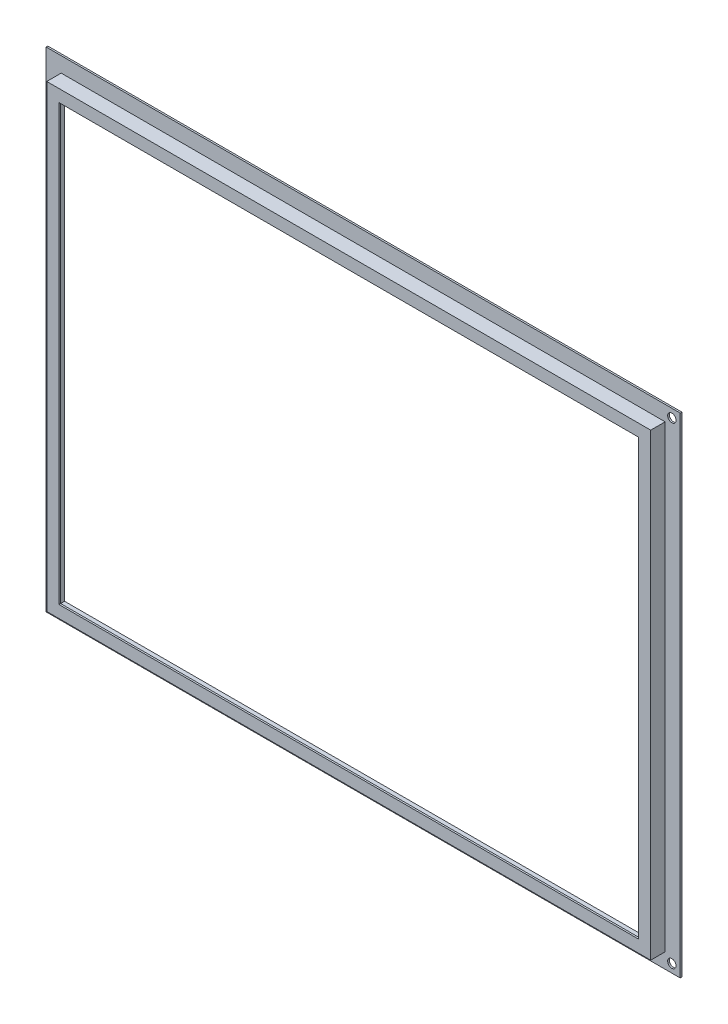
ISO-10303-21;
HEADER;
FILE_DESCRIPTION(('STEP AP214'),'2;1');
FILE_NAME('part.step','',(''),(''),'','','');
FILE_SCHEMA(('AUTOMOTIVE_DESIGN { 1 0 10303 214 1 1 1 1 }'));
ENDSEC;
DATA;
#1=APPLICATION_CONTEXT('core data for automotive mechanical design processes');
#2=APPLICATION_PROTOCOL_DEFINITION('international standard','automotive_design',2000,#1);
#3=PRODUCT_CONTEXT('',#1,'mechanical');
#4=PRODUCT('Part','Part','',(#3));
#5=PRODUCT_RELATED_PRODUCT_CATEGORY('part','',(#4));
#6=PRODUCT_DEFINITION_FORMATION('','',#4);
#7=PRODUCT_DEFINITION_CONTEXT('part definition',#1,'design');
#8=PRODUCT_DEFINITION('design','',#6,#7);
#9=PRODUCT_DEFINITION_SHAPE('','',#8);
#10=(LENGTH_UNIT() NAMED_UNIT(*) SI_UNIT(.MILLI.,.METRE.));
#11=(NAMED_UNIT(*) PLANE_ANGLE_UNIT() SI_UNIT($,.RADIAN.));
#12=(NAMED_UNIT(*) SI_UNIT($,.STERADIAN.) SOLID_ANGLE_UNIT());
#13=UNCERTAINTY_MEASURE_WITH_UNIT(LENGTH_MEASURE(1.E-05),#10,'distance_accuracy_value','');
#14=(GEOMETRIC_REPRESENTATION_CONTEXT(3) GLOBAL_UNCERTAINTY_ASSIGNED_CONTEXT((#13)) GLOBAL_UNIT_ASSIGNED_CONTEXT((#10,
#11,#12)) REPRESENTATION_CONTEXT('',''));
#15=CARTESIAN_POINT('',(0.,0.,0.));
#16=DIRECTION('',(0.,0.,1.));
#17=DIRECTION('',(1.,0.,0.));
#18=AXIS2_PLACEMENT_3D('',#15,#16,#17);
#19=CARTESIAN_POINT('',(178.969768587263,-136.790308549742,-459.709305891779));
#20=DIRECTION('',(0.,-1.,0.));
#21=DIRECTION('',(0.,0.,-1.));
#22=AXIS2_PLACEMENT_3D('',#19,#20,#21);
#23=PLANE('',#22);
#24=DIRECTION('',(0.,0.,1.));
#25=VECTOR('',#24,1.);
#26=CARTESIAN_POINT('',(-179.969768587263,-136.790308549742,-459.709305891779));
#27=LINE('',#26,#25);
#28=CARTESIAN_POINT('',(-179.969768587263,-136.790308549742,-7.6));
#29=VERTEX_POINT('',#28);
#30=CARTESIAN_POINT('',(-179.969768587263,-136.790308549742,1.));
#31=VERTEX_POINT('',#30);
#32=EDGE_CURVE('E281',#29,#31,#27,.T.);
#33=ORIENTED_EDGE('',*,*,#32,.F.);
#34=DIRECTION('',(1.,0.,0.));
#35=VECTOR('',#34,1.);
#36=CARTESIAN_POINT('',(178.969768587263,-136.790308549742,-7.6));
#37=LINE('',#36,#35);
#38=CARTESIAN_POINT('',(179.969768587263,-136.790308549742,-7.6));
#39=VERTEX_POINT('',#38);
#40=EDGE_CURVE('E291',#29,#39,#37,.T.);
#41=ORIENTED_EDGE('',*,*,#40,.T.);
#42=DIRECTION('',(0.,0.,1.));
#43=VECTOR('',#42,1.);
#44=CARTESIAN_POINT('',(179.969768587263,-136.790308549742,-459.709305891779));
#45=LINE('',#44,#43);
#46=CARTESIAN_POINT('',(179.969768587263,-136.790308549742,1.));
#47=VERTEX_POINT('',#46);
#48=EDGE_CURVE('E290',#39,#47,#45,.T.);
#49=ORIENTED_EDGE('',*,*,#48,.T.);
#50=DIRECTION('',(1.,0.,0.));
#51=VECTOR('',#50,1.);
#52=CARTESIAN_POINT('',(178.969768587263,-136.790308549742,1.));
#53=LINE('',#52,#51);
#54=EDGE_CURVE('E271',#31,#47,#53,.T.);
#55=ORIENTED_EDGE('',*,*,#54,.F.);
#56=EDGE_LOOP('',(#33,#41,#49,#55));
#57=FACE_BOUND('',#56,.T.);
#58=DIRECTION('',(-1.,0.,0.));
#59=VECTOR('',#58,1.);
#60=CARTESIAN_POINT('',(152.969768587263,-136.790308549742,-4.42500000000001));
#61=LINE('',#60,#59);
#62=CARTESIAN_POINT('',(152.969768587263,-136.790308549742,-4.42500000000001));
#63=VERTEX_POINT('',#62);
#64=CARTESIAN_POINT('',(102.469768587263,-136.790308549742,-4.42499999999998));
#65=VERTEX_POINT('',#64);
#66=EDGE_CURVE('E235',#63,#65,#61,.T.);
#67=ORIENTED_EDGE('',*,*,#66,.T.);
#68=DIRECTION('',(0.,0.,1.));
#69=VECTOR('',#68,1.);
#70=CARTESIAN_POINT('',(102.469768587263,-136.790308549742,-4.42499999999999));
#71=LINE('',#70,#69);
#72=CARTESIAN_POINT('',(102.469768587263,-136.790308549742,-1.92499999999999));
#73=VERTEX_POINT('',#72);
#74=EDGE_CURVE('E46',#65,#73,#71,.T.);
#75=ORIENTED_EDGE('',*,*,#74,.T.);
#76=DIRECTION('',(1.,0.,0.));
#77=VECTOR('',#76,1.);
#78=CARTESIAN_POINT('',(102.469768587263,-136.790308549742,-1.92499999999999));
#79=LINE('',#78,#77);
#80=CARTESIAN_POINT('',(152.969768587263,-136.790308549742,-1.92499999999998));
#81=VERTEX_POINT('',#80);
#82=EDGE_CURVE('E244',#73,#81,#79,.T.);
#83=ORIENTED_EDGE('',*,*,#82,.T.);
#84=DIRECTION('',(0.,0.,-1.));
#85=VECTOR('',#84,1.);
#86=CARTESIAN_POINT('',(152.969768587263,-136.790308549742,-1.92499999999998));
#87=LINE('',#86,#85);
#88=EDGE_CURVE('E240',#81,#63,#87,.T.);
#89=ORIENTED_EDGE('',*,*,#88,.T.);
#90=EDGE_LOOP('',(#67,#75,#83,#89));
#91=FACE_BOUND('',#90,.T.);
#92=ADVANCED_FACE('F29',(#57,#91),#23,.T.);
#93=CARTESIAN_POINT('',(-178.969768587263,-135.790308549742,-459.709305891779));
#94=DIRECTION('',(0.,-1.,0.));
#95=DIRECTION('',(0.,0.,-1.));
#96=AXIS2_PLACEMENT_3D('',#93,#94,#95);
#97=PLANE('',#96);
#98=DIRECTION('',(-1.,0.,0.));
#99=VECTOR('',#98,1.);
#100=CARTESIAN_POINT('',(178.969768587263,-135.790308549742,0.));
#101=LINE('',#100,#99);
#102=CARTESIAN_POINT('',(178.969768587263,-135.790308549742,0.));
#103=VERTEX_POINT('',#102);
#104=CARTESIAN_POINT('',(-178.969768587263,-135.790308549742,0.));
#105=VERTEX_POINT('',#104);
#106=EDGE_CURVE('E332',#103,#105,#101,.T.);
#107=ORIENTED_EDGE('',*,*,#106,.F.);
#108=DIRECTION('',(0.,0.,1.));
#109=VECTOR('',#108,1.);
#110=CARTESIAN_POINT('',(178.969768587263,-135.790308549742,-459.709305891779));
#111=LINE('',#110,#109);
#112=CARTESIAN_POINT('',(178.969768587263,-135.790308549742,-8.6));
#113=VERTEX_POINT('',#112);
#114=EDGE_CURVE('E263',#113,#103,#111,.T.);
#115=ORIENTED_EDGE('',*,*,#114,.F.);
#116=DIRECTION('',(1.,0.,0.));
#117=VECTOR('',#116,1.);
#118=CARTESIAN_POINT('',(-178.969768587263,-135.790308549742,-8.6));
#119=LINE('',#118,#117);
#120=CARTESIAN_POINT('',(-178.969768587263,-135.790308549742,-8.6));
#121=VERTEX_POINT('',#120);
#122=EDGE_CURVE('E187',#121,#113,#119,.T.);
#123=ORIENTED_EDGE('',*,*,#122,.F.);
#124=DIRECTION('',(0.,0.,1.));
#125=VECTOR('',#124,1.);
#126=CARTESIAN_POINT('',(-178.969768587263,-135.790308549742,-459.709305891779));
#127=LINE('',#126,#125);
#128=EDGE_CURVE('E183',#121,#105,#127,.T.);
#129=ORIENTED_EDGE('',*,*,#128,.T.);
#130=EDGE_LOOP('',(#107,#115,#123,#129));
#131=FACE_BOUND('',#130,.T.);
#132=DIRECTION('',(0.,0.,1.));
#133=VECTOR('',#132,1.);
#134=CARTESIAN_POINT('',(102.469768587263,-135.790308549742,-4.42499999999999));
#135=LINE('',#134,#133);
#136=CARTESIAN_POINT('',(102.469768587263,-135.790308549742,-4.42499999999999));
#137=VERTEX_POINT('',#136);
#138=CARTESIAN_POINT('',(102.469768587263,-135.790308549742,-1.92499999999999));
#139=VERTEX_POINT('',#138);
#140=EDGE_CURVE('E253',#137,#139,#135,.T.);
#141=ORIENTED_EDGE('',*,*,#140,.F.);
#142=DIRECTION('',(-1.,0.,0.));
#143=VECTOR('',#142,1.);
#144=CARTESIAN_POINT('',(152.969768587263,-135.790308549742,-4.42500000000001));
#145=LINE('',#144,#143);
#146=CARTESIAN_POINT('',(152.969768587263,-135.790308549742,-4.42500000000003));
#147=VERTEX_POINT('',#146);
#148=EDGE_CURVE('E238',#147,#137,#145,.T.);
#149=ORIENTED_EDGE('',*,*,#148,.F.);
#150=DIRECTION('',(0.,0.,-1.));
#151=VECTOR('',#150,1.);
#152=CARTESIAN_POINT('',(152.969768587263,-135.790308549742,-1.92499999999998));
#153=LINE('',#152,#151);
#154=CARTESIAN_POINT('',(152.969768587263,-135.790308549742,-1.92499999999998));
#155=VERTEX_POINT('',#154);
#156=EDGE_CURVE('E54',#155,#147,#153,.T.);
#157=ORIENTED_EDGE('',*,*,#156,.F.);
#158=DIRECTION('',(1.,0.,0.));
#159=VECTOR('',#158,1.);
#160=CARTESIAN_POINT('',(102.469768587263,-135.790308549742,-1.92499999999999));
#161=LINE('',#160,#159);
#162=EDGE_CURVE('E250',#139,#155,#161,.T.);
#163=ORIENTED_EDGE('',*,*,#162,.F.);
#164=EDGE_LOOP('',(#141,#149,#157,#163));
#165=FACE_BOUND('',#164,.T.);
#166=ADVANCED_FACE('F342',(#131,#165),#97,.F.);
#167=CARTESIAN_POINT('',(-178.969768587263,-135.790308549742,1.));
#168=DIRECTION('',(0.,0.,-1.));
#169=DIRECTION('',(-1.,0.,0.));
#170=AXIS2_PLACEMENT_3D('',#167,#168,#169);
#171=PLANE('',#170);
#172=DIRECTION('',(0.,1.,0.));
#173=VECTOR('',#172,1.);
#174=CARTESIAN_POINT('',(172.719768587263,-129.540308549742,1.));
#175=LINE('',#174,#173);
#176=CARTESIAN_POINT('',(172.719768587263,-129.540308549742,1.));
#177=VERTEX_POINT('',#176);
#178=CARTESIAN_POINT('',(172.719768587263,129.540308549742,1.));
#179=VERTEX_POINT('',#178);
#180=EDGE_CURVE('E318',#177,#179,#175,.T.);
#181=ORIENTED_EDGE('',*,*,#180,.F.);
#182=DIRECTION('',(-1.,0.,0.));
#183=VECTOR('',#182,1.);
#184=CARTESIAN_POINT('',(172.719768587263,-129.540308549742,1.));
#185=LINE('',#184,#183);
#186=CARTESIAN_POINT('',(-172.719768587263,-129.540308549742,1.));
#187=VERTEX_POINT('',#186);
#188=EDGE_CURVE('E309',#177,#187,#185,.T.);
#189=ORIENTED_EDGE('',*,*,#188,.T.);
#190=DIRECTION('',(0.,-1.,0.));
#191=VECTOR('',#190,1.);
#192=CARTESIAN_POINT('',(-172.719768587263,129.540308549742,1.));
#193=LINE('',#192,#191);
#194=CARTESIAN_POINT('',(-172.719768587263,129.540308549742,1.));
#195=VERTEX_POINT('',#194);
#196=EDGE_CURVE('E312',#195,#187,#193,.T.);
#197=ORIENTED_EDGE('',*,*,#196,.F.);
#198=DIRECTION('',(1.,0.,0.));
#199=VECTOR('',#198,1.);
#200=CARTESIAN_POINT('',(-172.719768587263,129.540308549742,1.));
#201=LINE('',#200,#199);
#202=EDGE_CURVE('E315',#195,#179,#201,.T.);
#203=ORIENTED_EDGE('',*,*,#202,.T.);
#204=EDGE_LOOP('',(#181,#189,#197,#203));
#205=FACE_BOUND('',#204,.T.);
#206=DIRECTION('',(-1.,0.,0.));
#207=VECTOR('',#206,1.);
#208=CARTESIAN_POINT('',(178.969768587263,136.790308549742,1.));
#209=LINE('',#208,#207);
#210=CARTESIAN_POINT('',(179.969768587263,136.790308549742,1.));
#211=VERTEX_POINT('',#210);
#212=CARTESIAN_POINT('',(-179.969768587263,136.790308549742,1.));
#213=VERTEX_POINT('',#212);
#214=EDGE_CURVE('E176',#211,#213,#209,.T.);
#215=ORIENTED_EDGE('',*,*,#214,.T.);
#216=DIRECTION('',(0.,-1.,0.));
#217=VECTOR('',#216,1.);
#218=CARTESIAN_POINT('',(-179.969768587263,135.790308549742,1.));
#219=LINE('',#218,#217);
#220=EDGE_CURVE('E274',#213,#31,#219,.T.);
#221=ORIENTED_EDGE('',*,*,#220,.T.);
#222=ORIENTED_EDGE('',*,*,#54,.T.);
#223=DIRECTION('',(0.,1.,0.));
#224=VECTOR('',#223,1.);
#225=CARTESIAN_POINT('',(179.969768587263,135.790308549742,1.));
#226=LINE('',#225,#224);
#227=EDGE_CURVE('E267',#47,#211,#226,.T.);
#228=ORIENTED_EDGE('',*,*,#227,.T.);
#229=EDGE_LOOP('',(#215,#221,#222,#228));
#230=FACE_BOUND('',#229,.T.);
#231=ADVANCED_FACE('F31',(#205,#230),#171,.F.);
#232=CARTESIAN_POINT('',(-178.969768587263,-135.790308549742,0.));
#233=DIRECTION('',(0.,0.,-1.));
#234=DIRECTION('',(-1.,0.,0.));
#235=AXIS2_PLACEMENT_3D('',#232,#233,#234);
#236=PLANE('',#235);
#237=DIRECTION('',(-1.,0.,0.));
#238=VECTOR('',#237,1.);
#239=CARTESIAN_POINT('',(172.719768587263,-129.540308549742,0.));
#240=LINE('',#239,#238);
#241=CARTESIAN_POINT('',(172.719768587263,-129.540308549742,0.));
#242=VERTEX_POINT('',#241);
#243=CARTESIAN_POINT('',(-172.719768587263,-129.540308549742,0.));
#244=VERTEX_POINT('',#243);
#245=EDGE_CURVE('E298',#242,#244,#240,.T.);
#246=ORIENTED_EDGE('',*,*,#245,.F.);
#247=DIRECTION('',(0.,1.,0.));
#248=VECTOR('',#247,1.);
#249=CARTESIAN_POINT('',(172.719768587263,-129.540308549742,0.));
#250=LINE('',#249,#248);
#251=CARTESIAN_POINT('',(172.719768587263,129.540308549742,0.));
#252=VERTEX_POINT('',#251);
#253=EDGE_CURVE('E306',#242,#252,#250,.T.);
#254=ORIENTED_EDGE('',*,*,#253,.T.);
#255=DIRECTION('',(1.,0.,0.));
#256=VECTOR('',#255,1.);
#257=CARTESIAN_POINT('',(-172.719768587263,129.540308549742,0.));
#258=LINE('',#257,#256);
#259=CARTESIAN_POINT('',(-172.719768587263,129.540308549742,0.));
#260=VERTEX_POINT('',#259);
#261=EDGE_CURVE('E303',#260,#252,#258,.T.);
#262=ORIENTED_EDGE('',*,*,#261,.F.);
#263=DIRECTION('',(0.,-1.,0.));
#264=VECTOR('',#263,1.);
#265=CARTESIAN_POINT('',(-172.719768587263,129.540308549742,0.));
#266=LINE('',#265,#264);
#267=EDGE_CURVE('E300',#260,#244,#266,.T.);
#268=ORIENTED_EDGE('',*,*,#267,.T.);
#269=EDGE_LOOP('',(#246,#254,#262,#268));
#270=FACE_BOUND('',#269,.T.);
#271=DIRECTION('',(0.,-1.,0.));
#272=VECTOR('',#271,1.);
#273=CARTESIAN_POINT('',(-178.969768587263,135.790308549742,0.));
#274=LINE('',#273,#272);
#275=CARTESIAN_POINT('',(-178.969768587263,135.790308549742,0.));
#276=VERTEX_POINT('',#275);
#277=EDGE_CURVE('E330',#276,#105,#274,.T.);
#278=ORIENTED_EDGE('',*,*,#277,.F.);
#279=DIRECTION('',(1.,0.,0.));
#280=VECTOR('',#279,1.);
#281=CARTESIAN_POINT('',(-178.969768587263,135.790308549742,0.));
#282=LINE('',#281,#280);
#283=CARTESIAN_POINT('',(178.969768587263,135.790308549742,0.));
#284=VERTEX_POINT('',#283);
#285=EDGE_CURVE('E11',#276,#284,#282,.T.);
#286=ORIENTED_EDGE('',*,*,#285,.T.);
#287=DIRECTION('',(0.,1.,0.));
#288=VECTOR('',#287,1.);
#289=CARTESIAN_POINT('',(178.969768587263,-135.790308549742,0.));
#290=LINE('',#289,#288);
#291=EDGE_CURVE('E38',#103,#284,#290,.T.);
#292=ORIENTED_EDGE('',*,*,#291,.F.);
#293=ORIENTED_EDGE('',*,*,#106,.T.);
#294=EDGE_LOOP('',(#278,#286,#292,#293));
#295=FACE_BOUND('',#294,.T.);
#296=ADVANCED_FACE('F340',(#270,#295),#236,.T.);
#297=CARTESIAN_POINT('',(172.719768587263,-129.540308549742,1.));
#298=DIRECTION('',(0.,-1.,0.));
#299=DIRECTION('',(0.,0.,-1.));
#300=AXIS2_PLACEMENT_3D('',#297,#298,#299);
#301=PLANE('',#300);
#302=DIRECTION('',(0.,0.,-1.));
#303=VECTOR('',#302,1.);
#304=CARTESIAN_POINT('',(172.719768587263,-129.540308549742,1.));
#305=LINE('',#304,#303);
#306=EDGE_CURVE('E328',#177,#242,#305,.T.);
#307=ORIENTED_EDGE('',*,*,#306,.T.);
#308=ORIENTED_EDGE('',*,*,#245,.T.);
#309=DIRECTION('',(0.,0.,-1.));
#310=VECTOR('',#309,1.);
#311=CARTESIAN_POINT('',(-172.719768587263,-129.540308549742,1.));
#312=LINE('',#311,#310);
#313=EDGE_CURVE('E321',#187,#244,#312,.T.);
#314=ORIENTED_EDGE('',*,*,#313,.F.);
#315=ORIENTED_EDGE('',*,*,#188,.F.);
#316=EDGE_LOOP('',(#307,#308,#314,#315));
#317=FACE_BOUND('',#316,.T.);
#318=ADVANCED_FACE('F382',(#317),#301,.F.);
#319=CARTESIAN_POINT('',(172.719768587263,-129.540308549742,1.));
#320=DIRECTION('',(-1.,0.,0.));
#321=DIRECTION('',(0.,-1.,0.));
#322=AXIS2_PLACEMENT_3D('',#319,#320,#321);
#323=PLANE('',#322);
#324=DIRECTION('',(0.,0.,-1.));
#325=VECTOR('',#324,1.);
#326=CARTESIAN_POINT('',(172.719768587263,129.540308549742,1.));
#327=LINE('',#326,#325);
#328=EDGE_CURVE('E326',#179,#252,#327,.T.);
#329=ORIENTED_EDGE('',*,*,#328,.T.);
#330=ORIENTED_EDGE('',*,*,#253,.F.);
#331=ORIENTED_EDGE('',*,*,#306,.F.);
#332=ORIENTED_EDGE('',*,*,#180,.T.);
#333=EDGE_LOOP('',(#329,#330,#331,#332));
#334=FACE_BOUND('',#333,.T.);
#335=ADVANCED_FACE('F385',(#334),#323,.T.);
#336=CARTESIAN_POINT('',(-172.719768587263,129.540308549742,1.));
#337=DIRECTION('',(0.,1.,0.));
#338=DIRECTION('',(-1.,0.,0.));
#339=AXIS2_PLACEMENT_3D('',#336,#337,#338);
#340=PLANE('',#339);
#341=DIRECTION('',(0.,0.,-1.));
#342=VECTOR('',#341,1.);
#343=CARTESIAN_POINT('',(-172.719768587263,129.540308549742,1.));
#344=LINE('',#343,#342);
#345=EDGE_CURVE('E324',#195,#260,#344,.T.);
#346=ORIENTED_EDGE('',*,*,#345,.T.);
#347=ORIENTED_EDGE('',*,*,#261,.T.);
#348=ORIENTED_EDGE('',*,*,#328,.F.);
#349=ORIENTED_EDGE('',*,*,#202,.F.);
#350=EDGE_LOOP('',(#346,#347,#348,#349));
#351=FACE_BOUND('',#350,.T.);
#352=ADVANCED_FACE('F389',(#351),#340,.F.);
#353=CARTESIAN_POINT('',(-172.719768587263,129.540308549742,1.));
#354=DIRECTION('',(1.,0.,0.));
#355=DIRECTION('',(0.,0.,-1.));
#356=AXIS2_PLACEMENT_3D('',#353,#354,#355);
#357=PLANE('',#356);
#358=ORIENTED_EDGE('',*,*,#196,.T.);
#359=ORIENTED_EDGE('',*,*,#313,.T.);
#360=ORIENTED_EDGE('',*,*,#267,.F.);
#361=ORIENTED_EDGE('',*,*,#345,.F.);
#362=EDGE_LOOP('',(#358,#359,#360,#361));
#363=FACE_BOUND('',#362,.T.);
#364=ADVANCED_FACE('F380',(#363),#357,.T.);
#365=CARTESIAN_POINT('',(-179.969768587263,135.790308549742,-459.709305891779));
#366=DIRECTION('',(-1.,0.,0.));
#367=DIRECTION('',(0.,0.,1.));
#368=AXIS2_PLACEMENT_3D('',#365,#366,#367);
#369=PLANE('',#368);
#370=DIRECTION('',(0.,0.,1.));
#371=VECTOR('',#370,1.);
#372=CARTESIAN_POINT('',(-179.969768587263,136.790308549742,-459.709305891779));
#373=LINE('',#372,#371);
#374=CARTESIAN_POINT('',(-179.969768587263,136.790308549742,-7.6));
#375=VERTEX_POINT('',#374);
#376=EDGE_CURVE('E285',#375,#213,#373,.T.);
#377=ORIENTED_EDGE('',*,*,#376,.F.);
#378=DIRECTION('',(0.,-1.,0.));
#379=VECTOR('',#378,1.);
#380=CARTESIAN_POINT('',(-179.969768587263,135.790308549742,-7.6));
#381=LINE('',#380,#379);
#382=EDGE_CURVE('E270',#375,#29,#381,.T.);
#383=ORIENTED_EDGE('',*,*,#382,.T.);
#384=ORIENTED_EDGE('',*,*,#32,.T.);
#385=ORIENTED_EDGE('',*,*,#220,.F.);
#386=EDGE_LOOP('',(#377,#383,#384,#385));
#387=FACE_BOUND('',#386,.T.);
#388=ADVANCED_FACE('F377',(#387),#369,.T.);
#389=CARTESIAN_POINT('',(179.969768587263,135.790308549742,-459.709305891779));
#390=DIRECTION('',(1.,0.,0.));
#391=DIRECTION('',(0.,1.,0.));
#392=AXIS2_PLACEMENT_3D('',#389,#390,#391);
#393=PLANE('',#392);
#394=ORIENTED_EDGE('',*,*,#48,.F.);
#395=DIRECTION('',(0.,1.,0.));
#396=VECTOR('',#395,1.);
#397=CARTESIAN_POINT('',(179.969768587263,135.790308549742,-7.6));
#398=LINE('',#397,#396);
#399=CARTESIAN_POINT('',(179.969768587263,136.790308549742,-7.6));
#400=VERTEX_POINT('',#399);
#401=EDGE_CURVE('E287',#39,#400,#398,.T.);
#402=ORIENTED_EDGE('',*,*,#401,.T.);
#403=DIRECTION('',(0.,0.,1.));
#404=VECTOR('',#403,1.);
#405=CARTESIAN_POINT('',(179.969768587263,136.790308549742,-459.709305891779));
#406=LINE('',#405,#404);
#407=EDGE_CURVE('E286',#400,#211,#406,.T.);
#408=ORIENTED_EDGE('',*,*,#407,.T.);
#409=ORIENTED_EDGE('',*,*,#227,.F.);
#410=EDGE_LOOP('',(#394,#402,#408,#409));
#411=FACE_BOUND('',#410,.T.);
#412=ADVANCED_FACE('F375',(#411),#393,.T.);
#413=CARTESIAN_POINT('',(178.969768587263,136.790308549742,-459.709305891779));
#414=DIRECTION('',(0.,1.,0.));
#415=DIRECTION('',(-1.,0.,0.));
#416=AXIS2_PLACEMENT_3D('',#413,#414,#415);
#417=PLANE('',#416);
#418=ORIENTED_EDGE('',*,*,#407,.F.);
#419=DIRECTION('',(-1.,0.,0.));
#420=VECTOR('',#419,1.);
#421=CARTESIAN_POINT('',(178.969768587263,136.790308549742,-7.6));
#422=LINE('',#421,#420);
#423=EDGE_CURVE('E282',#400,#375,#422,.T.);
#424=ORIENTED_EDGE('',*,*,#423,.T.);
#425=ORIENTED_EDGE('',*,*,#376,.T.);
#426=ORIENTED_EDGE('',*,*,#214,.F.);
#427=EDGE_LOOP('',(#418,#424,#425,#426));
#428=FACE_BOUND('',#427,.T.);
#429=ADVANCED_FACE('F420',(#428),#417,.T.);
#430=CARTESIAN_POINT('',(-178.969768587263,135.790308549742,-459.709305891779));
#431=DIRECTION('',(-1.,0.,0.));
#432=DIRECTION('',(0.,0.,1.));
#433=AXIS2_PLACEMENT_3D('',#430,#431,#432);
#434=PLANE('',#433);
#435=ORIENTED_EDGE('',*,*,#277,.T.);
#436=ORIENTED_EDGE('',*,*,#128,.F.);
#437=DIRECTION('',(0.,-1.,0.));
#438=VECTOR('',#437,1.);
#439=CARTESIAN_POINT('',(-178.969768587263,135.790308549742,-8.6));
#440=LINE('',#439,#438);
#441=CARTESIAN_POINT('',(-178.969768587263,135.790308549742,-8.6));
#442=VERTEX_POINT('',#441);
#443=EDGE_CURVE('E180',#442,#121,#440,.T.);
#444=ORIENTED_EDGE('',*,*,#443,.F.);
#445=DIRECTION('',(0.,0.,1.));
#446=VECTOR('',#445,1.);
#447=CARTESIAN_POINT('',(-178.969768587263,135.790308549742,-459.709305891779));
#448=LINE('',#447,#446);
#449=EDGE_CURVE('E168',#442,#276,#448,.T.);
#450=ORIENTED_EDGE('',*,*,#449,.T.);
#451=EDGE_LOOP('',(#435,#436,#444,#450));
#452=FACE_BOUND('',#451,.T.);
#453=ADVANCED_FACE('F181',(#452),#434,.F.);
#454=CARTESIAN_POINT('',(178.969768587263,-135.790308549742,-459.709305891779));
#455=DIRECTION('',(1.,0.,0.));
#456=DIRECTION('',(0.,1.,0.));
#457=AXIS2_PLACEMENT_3D('',#454,#455,#456);
#458=PLANE('',#457);
#459=ORIENTED_EDGE('',*,*,#291,.T.);
#460=DIRECTION('',(0.,0.,1.));
#461=VECTOR('',#460,1.);
#462=CARTESIAN_POINT('',(178.969768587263,135.790308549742,-459.709305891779));
#463=LINE('',#462,#461);
#464=CARTESIAN_POINT('',(178.969768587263,135.790308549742,-8.6));
#465=VERTEX_POINT('',#464);
#466=EDGE_CURVE('E177',#465,#284,#463,.T.);
#467=ORIENTED_EDGE('',*,*,#466,.F.);
#468=DIRECTION('',(0.,1.,0.));
#469=VECTOR('',#468,1.);
#470=CARTESIAN_POINT('',(178.969768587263,-135.790308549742,-8.6));
#471=LINE('',#470,#469);
#472=EDGE_CURVE('E192',#113,#465,#471,.T.);
#473=ORIENTED_EDGE('',*,*,#472,.F.);
#474=ORIENTED_EDGE('',*,*,#114,.T.);
#475=EDGE_LOOP('',(#459,#467,#473,#474));
#476=FACE_BOUND('',#475,.T.);
#477=ADVANCED_FACE('F338',(#476),#458,.F.);
#478=CARTESIAN_POINT('',(178.969768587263,135.790308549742,-459.709305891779));
#479=DIRECTION('',(0.,1.,0.));
#480=DIRECTION('',(-1.,0.,0.));
#481=AXIS2_PLACEMENT_3D('',#478,#479,#480);
#482=PLANE('',#481);
#483=ORIENTED_EDGE('',*,*,#285,.F.);
#484=ORIENTED_EDGE('',*,*,#449,.F.);
#485=DIRECTION('',(-1.,0.,0.));
#486=VECTOR('',#485,1.);
#487=CARTESIAN_POINT('',(178.969768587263,135.790308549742,-8.6));
#488=LINE('',#487,#486);
#489=EDGE_CURVE('E172',#465,#442,#488,.T.);
#490=ORIENTED_EDGE('',*,*,#489,.F.);
#491=ORIENTED_EDGE('',*,*,#466,.T.);
#492=EDGE_LOOP('',(#483,#484,#490,#491));
#493=FACE_BOUND('',#492,.T.);
#494=ADVANCED_FACE('F170',(#493),#482,.F.);
#495=CARTESIAN_POINT('',(102.469768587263,-85.2284652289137,-4.42499999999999));
#496=DIRECTION('',(1.,0.,0.));
#497=DIRECTION('',(0.,1.,0.));
#498=AXIS2_PLACEMENT_3D('',#495,#496,#497);
#499=PLANE('',#498);
#500=ORIENTED_EDGE('',*,*,#140,.T.);
#501=DIRECTION('',(0.,-1.,0.));
#502=VECTOR('',#501,1.);
#503=CARTESIAN_POINT('',(102.469768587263,-85.2284652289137,-1.92499999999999));
#504=LINE('',#503,#502);
#505=EDGE_CURVE('E247',#139,#73,#504,.T.);
#506=ORIENTED_EDGE('',*,*,#505,.T.);
#507=ORIENTED_EDGE('',*,*,#74,.F.);
#508=DIRECTION('',(0.,-1.,0.));
#509=VECTOR('',#508,1.);
#510=CARTESIAN_POINT('',(102.469768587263,-85.2284652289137,-4.42499999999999));
#511=LINE('',#510,#509);
#512=EDGE_CURVE('E234',#137,#65,#511,.T.);
#513=ORIENTED_EDGE('',*,*,#512,.F.);
#514=EDGE_LOOP('',(#500,#506,#507,#513));
#515=FACE_BOUND('',#514,.T.);
#516=ADVANCED_FACE('F349',(#515),#499,.T.);
#517=CARTESIAN_POINT('',(102.469768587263,-85.2284652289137,-1.92499999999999));
#518=DIRECTION('',(0.,0.,-1.));
#519=DIRECTION('',(-1.,0.,0.));
#520=AXIS2_PLACEMENT_3D('',#517,#518,#519);
#521=PLANE('',#520);
#522=ORIENTED_EDGE('',*,*,#162,.T.);
#523=DIRECTION('',(0.,-1.,0.));
#524=VECTOR('',#523,1.);
#525=CARTESIAN_POINT('',(152.969768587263,-85.2284652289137,-1.92499999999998));
#526=LINE('',#525,#524);
#527=EDGE_CURVE('E243',#155,#81,#526,.T.);
#528=ORIENTED_EDGE('',*,*,#527,.T.);
#529=ORIENTED_EDGE('',*,*,#82,.F.);
#530=ORIENTED_EDGE('',*,*,#505,.F.);
#531=EDGE_LOOP('',(#522,#528,#529,#530));
#532=FACE_BOUND('',#531,.T.);
#533=ADVANCED_FACE('F358',(#532),#521,.T.);
#534=CARTESIAN_POINT('',(152.969768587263,-85.2284652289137,-1.92499999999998));
#535=DIRECTION('',(-1.,0.,0.));
#536=DIRECTION('',(0.,-1.,0.));
#537=AXIS2_PLACEMENT_3D('',#534,#535,#536);
#538=PLANE('',#537);
#539=ORIENTED_EDGE('',*,*,#156,.T.);
#540=DIRECTION('',(0.,-1.,0.));
#541=VECTOR('',#540,1.);
#542=CARTESIAN_POINT('',(152.969768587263,-85.2284652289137,-4.42500000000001));
#543=LINE('',#542,#541);
#544=EDGE_CURVE('E239',#147,#63,#543,.T.);
#545=ORIENTED_EDGE('',*,*,#544,.T.);
#546=ORIENTED_EDGE('',*,*,#88,.F.);
#547=ORIENTED_EDGE('',*,*,#527,.F.);
#548=EDGE_LOOP('',(#539,#545,#546,#547));
#549=FACE_BOUND('',#548,.T.);
#550=ADVANCED_FACE('F355',(#549),#538,.T.);
#551=CARTESIAN_POINT('',(152.969768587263,-85.2284652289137,-4.42500000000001));
#552=DIRECTION('',(0.,0.,1.));
#553=DIRECTION('',(1.,0.,0.));
#554=AXIS2_PLACEMENT_3D('',#551,#552,#553);
#555=PLANE('',#554);
#556=ORIENTED_EDGE('',*,*,#148,.T.);
#557=ORIENTED_EDGE('',*,*,#512,.T.);
#558=ORIENTED_EDGE('',*,*,#66,.F.);
#559=ORIENTED_EDGE('',*,*,#544,.F.);
#560=EDGE_LOOP('',(#556,#557,#558,#559));
#561=FACE_BOUND('',#560,.T.);
#562=ADVANCED_FACE('F353',(#561),#555,.T.);
#563=CARTESIAN_POINT('',(188.969768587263,145.790308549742,-8.6));
#564=DIRECTION('',(0.,1.,0.));
#565=DIRECTION('',(-1.,0.,0.));
#566=AXIS2_PLACEMENT_3D('',#563,#564,#565);
#567=PLANE('',#566);
#568=DIRECTION('',(0.,0.,1.));
#569=VECTOR('',#568,1.);
#570=CARTESIAN_POINT('',(188.969768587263,145.790308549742,-8.6));
#571=LINE('',#570,#569);
#572=CARTESIAN_POINT('',(188.969768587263,145.790308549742,-8.6));
#573=VERTEX_POINT('',#572);
#574=CARTESIAN_POINT('',(188.969768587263,145.790308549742,-7.6));
#575=VERTEX_POINT('',#574);
#576=EDGE_CURVE('E232',#573,#575,#571,.T.);
#577=ORIENTED_EDGE('',*,*,#576,.F.);
#578=DIRECTION('',(-1.,0.,0.));
#579=VECTOR('',#578,1.);
#580=CARTESIAN_POINT('',(188.969768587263,145.790308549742,-8.6));
#581=LINE('',#580,#579);
#582=CARTESIAN_POINT('',(-188.969768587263,145.790308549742,-8.6));
#583=VERTEX_POINT('',#582);
#584=EDGE_CURVE('E214',#573,#583,#581,.T.);
#585=ORIENTED_EDGE('',*,*,#584,.T.);
#586=DIRECTION('',(0.,0.,1.));
#587=VECTOR('',#586,1.);
#588=CARTESIAN_POINT('',(-188.969768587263,145.790308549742,-8.6));
#589=LINE('',#588,#587);
#590=CARTESIAN_POINT('',(-188.969768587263,145.790308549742,-7.6));
#591=VERTEX_POINT('',#590);
#592=EDGE_CURVE('E226',#583,#591,#589,.T.);
#593=ORIENTED_EDGE('',*,*,#592,.T.);
#594=DIRECTION('',(-1.,0.,0.));
#595=VECTOR('',#594,1.);
#596=CARTESIAN_POINT('',(188.969768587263,145.790308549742,-7.6));
#597=LINE('',#596,#595);
#598=EDGE_CURVE('E202',#575,#591,#597,.T.);
#599=ORIENTED_EDGE('',*,*,#598,.F.);
#600=EDGE_LOOP('',(#577,#585,#593,#599));
#601=FACE_BOUND('',#600,.T.);
#602=ADVANCED_FACE('F443',(#601),#567,.T.);
#603=CARTESIAN_POINT('',(188.969768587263,-145.790308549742,-8.6));
#604=DIRECTION('',(1.,0.,0.));
#605=DIRECTION('',(0.,1.,0.));
#606=AXIS2_PLACEMENT_3D('',#603,#604,#605);
#607=PLANE('',#606);
#608=DIRECTION('',(0.,0.,1.));
#609=VECTOR('',#608,1.);
#610=CARTESIAN_POINT('',(188.969768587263,-145.790308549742,-8.6));
#611=LINE('',#610,#609);
#612=CARTESIAN_POINT('',(188.969768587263,-145.790308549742,-8.6));
#613=VERTEX_POINT('',#612);
#614=CARTESIAN_POINT('',(188.969768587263,-145.790308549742,-7.6));
#615=VERTEX_POINT('',#614);
#616=EDGE_CURVE('E230',#613,#615,#611,.T.);
#617=ORIENTED_EDGE('',*,*,#616,.F.);
#618=DIRECTION('',(0.,1.,0.));
#619=VECTOR('',#618,1.);
#620=CARTESIAN_POINT('',(188.969768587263,-145.790308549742,-8.6));
#621=LINE('',#620,#619);
#622=EDGE_CURVE('E223',#613,#573,#621,.T.);
#623=ORIENTED_EDGE('',*,*,#622,.T.);
#624=ORIENTED_EDGE('',*,*,#576,.T.);
#625=DIRECTION('',(0.,1.,0.));
#626=VECTOR('',#625,1.);
#627=CARTESIAN_POINT('',(188.969768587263,-145.790308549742,-7.6));
#628=LINE('',#627,#626);
#629=EDGE_CURVE('E211',#615,#575,#628,.T.);
#630=ORIENTED_EDGE('',*,*,#629,.F.);
#631=EDGE_LOOP('',(#617,#623,#624,#630));
#632=FACE_BOUND('',#631,.T.);
#633=ADVANCED_FACE('F441',(#632),#607,.T.);
#634=CARTESIAN_POINT('',(-188.969768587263,-145.790308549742,-8.6));
#635=DIRECTION('',(0.,-1.,0.));
#636=DIRECTION('',(0.,0.,-1.));
#637=AXIS2_PLACEMENT_3D('',#634,#635,#636);
#638=PLANE('',#637);
#639=DIRECTION('',(0.,0.,1.));
#640=VECTOR('',#639,1.);
#641=CARTESIAN_POINT('',(-188.969768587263,-145.790308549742,-8.6));
#642=LINE('',#641,#640);
#643=CARTESIAN_POINT('',(-188.969768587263,-145.790308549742,-8.6));
#644=VERTEX_POINT('',#643);
#645=CARTESIAN_POINT('',(-188.969768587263,-145.790308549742,-7.6));
#646=VERTEX_POINT('',#645);
#647=EDGE_CURVE('E228',#644,#646,#642,.T.);
#648=ORIENTED_EDGE('',*,*,#647,.F.);
#649=DIRECTION('',(1.,0.,0.));
#650=VECTOR('',#649,1.);
#651=CARTESIAN_POINT('',(-188.969768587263,-145.790308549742,-8.6));
#652=LINE('',#651,#650);
#653=EDGE_CURVE('E220',#644,#613,#652,.T.);
#654=ORIENTED_EDGE('',*,*,#653,.T.);
#655=ORIENTED_EDGE('',*,*,#616,.T.);
#656=DIRECTION('',(1.,0.,0.));
#657=VECTOR('',#656,1.);
#658=CARTESIAN_POINT('',(-188.969768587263,-145.790308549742,-7.6));
#659=LINE('',#658,#657);
#660=EDGE_CURVE('E208',#646,#615,#659,.T.);
#661=ORIENTED_EDGE('',*,*,#660,.F.);
#662=EDGE_LOOP('',(#648,#654,#655,#661));
#663=FACE_BOUND('',#662,.T.);
#664=ADVANCED_FACE('F438',(#663),#638,.T.);
#665=CARTESIAN_POINT('',(-188.969768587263,145.790308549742,-8.6));
#666=DIRECTION('',(-1.,0.,0.));
#667=DIRECTION('',(0.,-1.,0.));
#668=AXIS2_PLACEMENT_3D('',#665,#666,#667);
#669=PLANE('',#668);
#670=DIRECTION('',(0.,-1.,0.));
#671=VECTOR('',#670,1.);
#672=CARTESIAN_POINT('',(-188.969768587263,145.790308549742,-8.6));
#673=LINE('',#672,#671);
#674=EDGE_CURVE('E217',#583,#644,#673,.T.);
#675=ORIENTED_EDGE('',*,*,#674,.T.);
#676=ORIENTED_EDGE('',*,*,#647,.T.);
#677=DIRECTION('',(0.,-1.,0.));
#678=VECTOR('',#677,1.);
#679=CARTESIAN_POINT('',(-188.969768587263,145.790308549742,-7.6));
#680=LINE('',#679,#678);
#681=EDGE_CURVE('E205',#591,#646,#680,.T.);
#682=ORIENTED_EDGE('',*,*,#681,.F.);
#683=ORIENTED_EDGE('',*,*,#592,.F.);
#684=EDGE_LOOP('',(#675,#676,#682,#683));
#685=FACE_BOUND('',#684,.T.);
#686=ADVANCED_FACE('F428',(#685),#669,.T.);
#687=CARTESIAN_POINT('',(188.969768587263,145.790308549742,-8.6));
#688=DIRECTION('',(0.,0.,-1.));
#689=DIRECTION('',(-1.,0.,0.));
#690=AXIS2_PLACEMENT_3D('',#687,#688,#689);
#691=PLANE('',#690);
#692=CARTESIAN_POINT('',(183.969768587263,-140.790308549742,-8.6));
#693=DIRECTION('',(0.,0.,-1.));
#694=DIRECTION('',(-1.,0.,0.));
#695=AXIS2_PLACEMENT_3D('',#692,#693,#694);
#696=CIRCLE('',#695,2.5);
#697=CARTESIAN_POINT('',(181.469768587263,-140.790308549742,-8.6));
#698=VERTEX_POINT('',#697);
#699=EDGE_CURVE('E516',#698,#698,#696,.T.);
#700=ORIENTED_EDGE('',*,*,#699,.F.);
#701=EDGE_LOOP('',(#700));
#702=FACE_BOUND('',#701,.T.);
#703=CARTESIAN_POINT('',(183.969768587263,140.790308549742,-8.6));
#704=DIRECTION('',(0.,0.,-1.));
#705=DIRECTION('',(-1.,0.,0.));
#706=AXIS2_PLACEMENT_3D('',#703,#704,#705);
#707=CIRCLE('',#706,2.5);
#708=CARTESIAN_POINT('',(181.469768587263,140.790308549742,-8.6));
#709=VERTEX_POINT('',#708);
#710=EDGE_CURVE('E196',#709,#709,#707,.T.);
#711=ORIENTED_EDGE('',*,*,#710,.F.);
#712=EDGE_LOOP('',(#711));
#713=FACE_BOUND('',#712,.T.);
#714=ORIENTED_EDGE('',*,*,#489,.T.);
#715=ORIENTED_EDGE('',*,*,#443,.T.);
#716=ORIENTED_EDGE('',*,*,#122,.T.);
#717=ORIENTED_EDGE('',*,*,#472,.T.);
#718=EDGE_LOOP('',(#714,#715,#716,#717));
#719=FACE_BOUND('',#718,.T.);
#720=ORIENTED_EDGE('',*,*,#584,.F.);
#721=ORIENTED_EDGE('',*,*,#622,.F.);
#722=ORIENTED_EDGE('',*,*,#653,.F.);
#723=ORIENTED_EDGE('',*,*,#674,.F.);
#724=EDGE_LOOP('',(#720,#721,#722,#723));
#725=FACE_BOUND('',#724,.T.);
#726=ADVANCED_FACE('F189',(#702,#713,#719,#725),#691,.T.);
#727=CARTESIAN_POINT('',(188.969768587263,145.790308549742,-7.6));
#728=DIRECTION('',(0.,0.,-1.));
#729=DIRECTION('',(-1.,0.,0.));
#730=AXIS2_PLACEMENT_3D('',#727,#728,#729);
#731=PLANE('',#730);
#732=CARTESIAN_POINT('',(183.969768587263,-140.790308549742,-7.6));
#733=DIRECTION('',(0.,0.,-1.));
#734=DIRECTION('',(-1.,0.,0.));
#735=AXIS2_PLACEMENT_3D('',#732,#733,#734);
#736=CIRCLE('',#735,2.5);
#737=CARTESIAN_POINT('',(181.469768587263,-140.790308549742,-7.6));
#738=VERTEX_POINT('',#737);
#739=EDGE_CURVE('E33',#738,#738,#736,.T.);
#740=ORIENTED_EDGE('',*,*,#739,.T.);
#741=EDGE_LOOP('',(#740));
#742=FACE_BOUND('',#741,.T.);
#743=CARTESIAN_POINT('',(183.969768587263,140.790308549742,-7.6));
#744=DIRECTION('',(0.,0.,-1.));
#745=DIRECTION('',(-1.,0.,0.));
#746=AXIS2_PLACEMENT_3D('',#743,#744,#745);
#747=CIRCLE('',#746,2.5);
#748=CARTESIAN_POINT('',(181.469768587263,140.790308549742,-7.6));
#749=VERTEX_POINT('',#748);
#750=EDGE_CURVE('E193',#749,#749,#747,.T.);
#751=ORIENTED_EDGE('',*,*,#750,.T.);
#752=EDGE_LOOP('',(#751));
#753=FACE_BOUND('',#752,.T.);
#754=ORIENTED_EDGE('',*,*,#423,.F.);
#755=ORIENTED_EDGE('',*,*,#401,.F.);
#756=ORIENTED_EDGE('',*,*,#40,.F.);
#757=ORIENTED_EDGE('',*,*,#382,.F.);
#758=EDGE_LOOP('',(#754,#755,#756,#757));
#759=FACE_BOUND('',#758,.T.);
#760=ORIENTED_EDGE('',*,*,#598,.T.);
#761=ORIENTED_EDGE('',*,*,#681,.T.);
#762=ORIENTED_EDGE('',*,*,#660,.T.);
#763=ORIENTED_EDGE('',*,*,#629,.T.);
#764=EDGE_LOOP('',(#760,#761,#762,#763));
#765=FACE_BOUND('',#764,.T.);
#766=ADVANCED_FACE('F422',(#742,#753,#759,#765),#731,.F.);
#767=CARTESIAN_POINT('',(183.969768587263,140.790308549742,1.));
#768=DIRECTION('',(0.,0.,-1.));
#769=DIRECTION('',(-1.,0.,0.));
#770=AXIS2_PLACEMENT_3D('',#767,#768,#769);
#771=CYLINDRICAL_SURFACE('',#770,2.5);
#772=ORIENTED_EDGE('',*,*,#710,.T.);
#773=EDGE_LOOP('',(#772));
#774=FACE_BOUND('',#773,.T.);
#775=ORIENTED_EDGE('',*,*,#750,.F.);
#776=EDGE_LOOP('',(#775));
#777=FACE_BOUND('',#776,.T.);
#778=ADVANCED_FACE('F425',(#774,#777),#771,.F.);
#779=CARTESIAN_POINT('',(183.969768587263,-140.790308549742,1.));
#780=DIRECTION('',(0.,0.,-1.));
#781=DIRECTION('',(-1.,0.,0.));
#782=AXIS2_PLACEMENT_3D('',#779,#780,#781);
#783=CYLINDRICAL_SURFACE('',#782,2.5);
#784=ORIENTED_EDGE('',*,*,#699,.T.);
#785=EDGE_LOOP('',(#784));
#786=FACE_BOUND('',#785,.T.);
#787=ORIENTED_EDGE('',*,*,#739,.F.);
#788=EDGE_LOOP('',(#787));
#789=FACE_BOUND('',#788,.T.);
#790=ADVANCED_FACE('F500',(#786,#789),#783,.F.);
#791=CLOSED_SHELL('',(#92,#166,#231,#296,#318,#335,#352,#364,#388,#412,#429,#453,#477,#494,#516,
#533,#550,#562,#602,#633,#664,#686,#726,#766,#778,#790));
#792=MANIFOLD_SOLID_BREP('B2',#791);
#793=ADVANCED_BREP_SHAPE_REPRESENTATION('',(#18,#792),#14);
#794=SHAPE_DEFINITION_REPRESENTATION(#9,#793);
ENDSEC;
END-ISO-10303-21;
